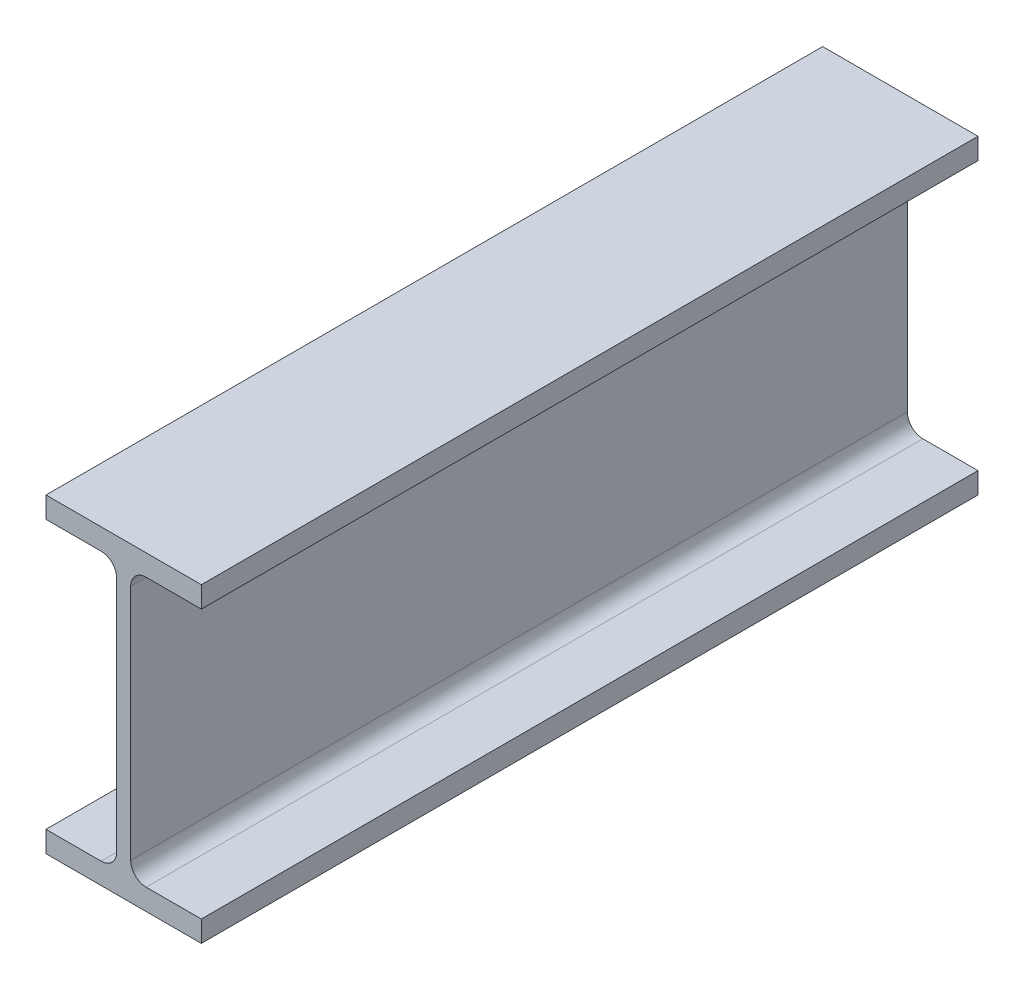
from build123d import *

# Parameters (mm, degrees)
AUFSATZ_LINEAR_AUSTRAGEN1_DEPTH = 250


with BuildPart() as part:
    # Skizze1 → Aufsatz-Linear austragen1 (new body)
    with BuildSketch(Plane.XY):
        with BuildLine():
            Line((-50, 100), (0, 100))
            Line((0, 100), (0, 93.2))
            Line((0, 93.2), (-17.75, 93.2))
            ThreePointArc((-17.75, 93.2), (-21.285533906, 91.735533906), (-22.75, 88.2))
            Line((-22.75, 88.2), (-22.75, 11.8))
            ThreePointArc((-22.75, 11.8), (-21.285533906, 8.264466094), (-17.75, 6.8))
            Line((-17.75, 6.8), (0, 6.8))
            Line((0, 6.8), (0, 0))
            Line((0, 0), (-50, 0))
            Line((-50, 0), (-50, 6.8))
            Line((-50, 6.8), (-32.25, 6.8))
            ThreePointArc((-32.25, 6.8), (-28.714466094, 8.264466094), (-27.25, 11.8))
            Line((-27.25, 11.8), (-27.25, 88.2))
            ThreePointArc((-27.25, 88.2), (-28.714466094, 91.735533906), (-32.25, 93.2))
            Line((-32.25, 93.2), (-50, 93.2))
            Line((-50, 93.2), (-50, 100))
        make_face()
    extrude(amount=AUFSATZ_LINEAR_AUSTRAGEN1_DEPTH)


solid = part.part
